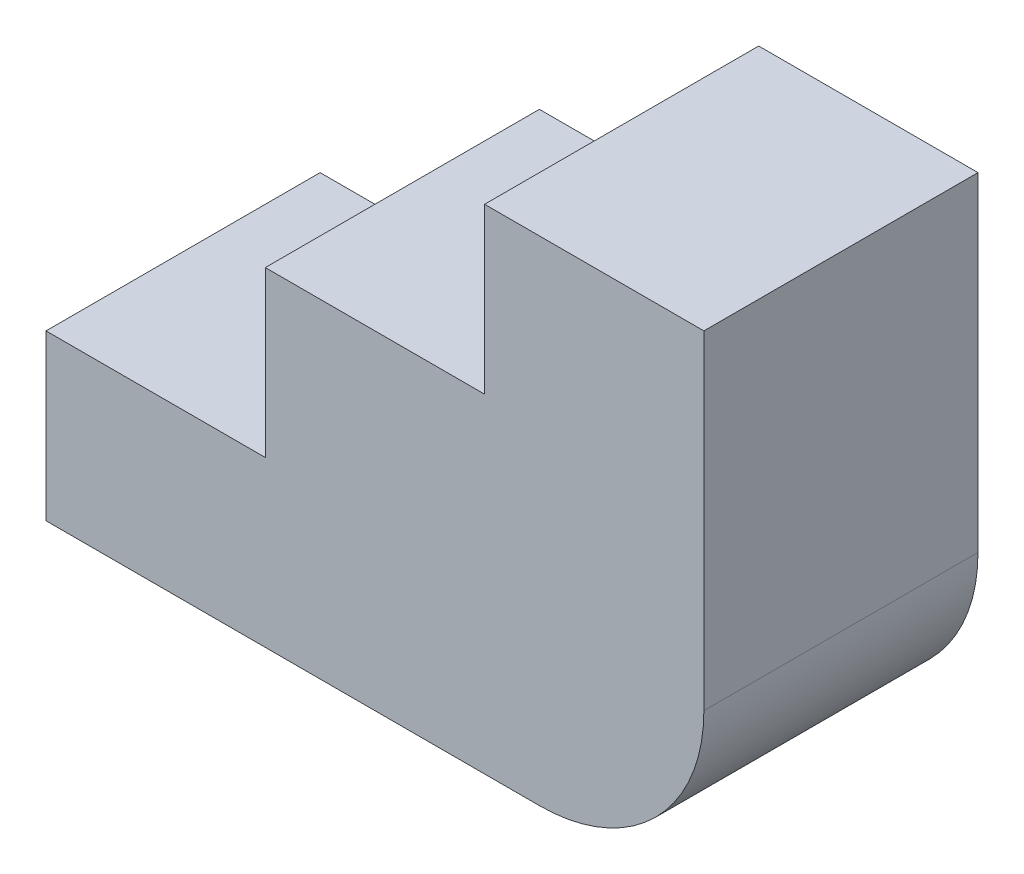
ISO-10303-21;
HEADER;
FILE_DESCRIPTION(('STEP AP214'),'2;1');
FILE_NAME('part.step','',(''),(''),'','','');
FILE_SCHEMA(('AUTOMOTIVE_DESIGN { 1 0 10303 214 1 1 1 1 }'));
ENDSEC;
DATA;
#1=APPLICATION_CONTEXT('core data for automotive mechanical design processes');
#2=APPLICATION_PROTOCOL_DEFINITION('international standard','automotive_design',2000,#1);
#3=PRODUCT_CONTEXT('',#1,'mechanical');
#4=PRODUCT('Part','Part','',(#3));
#5=PRODUCT_RELATED_PRODUCT_CATEGORY('part','',(#4));
#6=PRODUCT_DEFINITION_FORMATION('','',#4);
#7=PRODUCT_DEFINITION_CONTEXT('part definition',#1,'design');
#8=PRODUCT_DEFINITION('design','',#6,#7);
#9=PRODUCT_DEFINITION_SHAPE('','',#8);
#10=(LENGTH_UNIT() NAMED_UNIT(*) SI_UNIT(.MILLI.,.METRE.));
#11=(NAMED_UNIT(*) PLANE_ANGLE_UNIT() SI_UNIT($,.RADIAN.));
#12=(NAMED_UNIT(*) SI_UNIT($,.STERADIAN.) SOLID_ANGLE_UNIT());
#13=UNCERTAINTY_MEASURE_WITH_UNIT(LENGTH_MEASURE(1.E-05),#10,'distance_accuracy_value','');
#14=(GEOMETRIC_REPRESENTATION_CONTEXT(3) GLOBAL_UNCERTAINTY_ASSIGNED_CONTEXT((#13)) GLOBAL_UNIT_ASSIGNED_CONTEXT((#10,
#11,#12)) REPRESENTATION_CONTEXT('',''));
#15=CARTESIAN_POINT('',(0.,0.,0.));
#16=DIRECTION('',(0.,0.,1.));
#17=DIRECTION('',(1.,0.,0.));
#18=AXIS2_PLACEMENT_3D('',#15,#16,#17);
#19=CARTESIAN_POINT('',(0.,0.,25.));
#20=DIRECTION('',(0.,-1.,0.));
#21=DIRECTION('',(0.,0.,-1.));
#22=AXIS2_PLACEMENT_3D('',#19,#20,#21);
#23=PLANE('',#22);
#24=DIRECTION('',(-1.,0.,0.));
#25=VECTOR('',#24,1.);
#26=CARTESIAN_POINT('',(0.,0.,0.));
#27=LINE('',#26,#25);
#28=CARTESIAN_POINT('',(20.,0.,0.));
#29=VERTEX_POINT('',#28);
#30=CARTESIAN_POINT('',(0.,0.,0.));
#31=VERTEX_POINT('',#30);
#32=EDGE_CURVE('E152',#29,#31,#27,.T.);
#33=ORIENTED_EDGE('',*,*,#32,.T.);
#34=DIRECTION('',(0.,0.,-1.));
#35=VECTOR('',#34,1.);
#36=CARTESIAN_POINT('',(0.,0.,25.));
#37=LINE('',#36,#35);
#38=CARTESIAN_POINT('',(0.,0.,25.));
#39=VERTEX_POINT('',#38);
#40=EDGE_CURVE('E11',#39,#31,#37,.T.);
#41=ORIENTED_EDGE('',*,*,#40,.F.);
#42=DIRECTION('',(-1.,0.,0.));
#43=VECTOR('',#42,1.);
#44=CARTESIAN_POINT('',(0.,0.,25.));
#45=LINE('',#44,#43);
#46=CARTESIAN_POINT('',(20.,0.,25.));
#47=VERTEX_POINT('',#46);
#48=EDGE_CURVE('E177',#47,#39,#45,.T.);
#49=ORIENTED_EDGE('',*,*,#48,.F.);
#50=DIRECTION('',(0.,0.,-1.));
#51=VECTOR('',#50,1.);
#52=CARTESIAN_POINT('',(20.,0.,25.));
#53=LINE('',#52,#51);
#54=EDGE_CURVE('E148',#47,#29,#53,.T.);
#55=ORIENTED_EDGE('',*,*,#54,.T.);
#56=EDGE_LOOP('',(#33,#41,#49,#55));
#57=FACE_BOUND('',#56,.T.);
#58=ADVANCED_FACE('F45',(#57),#23,.F.);
#59=CARTESIAN_POINT('',(0.,0.,25.));
#60=DIRECTION('',(1.,0.,0.));
#61=DIRECTION('',(0.,0.,-1.));
#62=AXIS2_PLACEMENT_3D('',#59,#60,#61);
#63=PLANE('',#62);
#64=DIRECTION('',(0.,-1.,0.));
#65=VECTOR('',#64,1.);
#66=CARTESIAN_POINT('',(0.,0.,0.));
#67=LINE('',#66,#65);
#68=CARTESIAN_POINT('',(0.,-15.,0.));
#69=VERTEX_POINT('',#68);
#70=EDGE_CURVE('E156',#31,#69,#67,.T.);
#71=ORIENTED_EDGE('',*,*,#70,.T.);
#72=DIRECTION('',(0.,0.,-1.));
#73=VECTOR('',#72,1.);
#74=CARTESIAN_POINT('',(0.,-15.,25.));
#75=LINE('',#74,#73);
#76=CARTESIAN_POINT('',(0.,-15.,25.));
#77=VERTEX_POINT('',#76);
#78=EDGE_CURVE('E54',#77,#69,#75,.T.);
#79=ORIENTED_EDGE('',*,*,#78,.F.);
#80=DIRECTION('',(0.,-1.,0.));
#81=VECTOR('',#80,1.);
#82=CARTESIAN_POINT('',(0.,0.,25.));
#83=LINE('',#82,#81);
#84=EDGE_CURVE('E108',#39,#77,#83,.T.);
#85=ORIENTED_EDGE('',*,*,#84,.F.);
#86=ORIENTED_EDGE('',*,*,#40,.T.);
#87=EDGE_LOOP('',(#71,#79,#85,#86));
#88=FACE_BOUND('',#87,.T.);
#89=ADVANCED_FACE('F233',(#88),#63,.F.);
#90=CARTESIAN_POINT('',(0.,-15.,25.));
#91=DIRECTION('',(0.,1.,0.));
#92=DIRECTION('',(0.,0.,1.));
#93=AXIS2_PLACEMENT_3D('',#90,#91,#92);
#94=PLANE('',#93);
#95=DIRECTION('',(1.,0.,0.));
#96=VECTOR('',#95,1.);
#97=CARTESIAN_POINT('',(0.,-15.,0.));
#98=LINE('',#97,#96);
#99=CARTESIAN_POINT('',(44.9999999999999,-15.,0.));
#100=VERTEX_POINT('',#99);
#101=EDGE_CURVE('E159',#69,#100,#98,.T.);
#102=ORIENTED_EDGE('',*,*,#101,.T.);
#103=DIRECTION('',(0.,0.,-1.));
#104=VECTOR('',#103,1.);
#105=CARTESIAN_POINT('',(44.9999999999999,-15.,25.));
#106=LINE('',#105,#104);
#107=CARTESIAN_POINT('',(44.9999999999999,-15.,25.));
#108=VERTEX_POINT('',#107);
#109=EDGE_CURVE('E192',#108,#100,#106,.T.);
#110=ORIENTED_EDGE('',*,*,#109,.F.);
#111=DIRECTION('',(1.,0.,0.));
#112=VECTOR('',#111,1.);
#113=CARTESIAN_POINT('',(0.,-15.,25.));
#114=LINE('',#113,#112);
#115=EDGE_CURVE('E202',#77,#108,#114,.T.);
#116=ORIENTED_EDGE('',*,*,#115,.F.);
#117=ORIENTED_EDGE('',*,*,#78,.T.);
#118=EDGE_LOOP('',(#102,#110,#116,#117));
#119=FACE_BOUND('',#118,.T.);
#120=ADVANCED_FACE('F200',(#119),#94,.F.);
#121=CARTESIAN_POINT('',(45.,0.,25.));
#122=DIRECTION('',(0.,0.,-1.));
#123=DIRECTION('',(-1.,0.,0.));
#124=AXIS2_PLACEMENT_3D('',#121,#122,#123);
#125=CYLINDRICAL_SURFACE('',#124,15.);
#126=CARTESIAN_POINT('',(45.,0.,0.));
#127=DIRECTION('',(0.,0.,1.));
#128=DIRECTION('',(1.,0.,0.));
#129=AXIS2_PLACEMENT_3D('',#126,#127,#128);
#130=CIRCLE('',#129,15.);
#131=CARTESIAN_POINT('',(60.,0.,0.));
#132=VERTEX_POINT('',#131);
#133=EDGE_CURVE('E162',#100,#132,#130,.T.);
#134=ORIENTED_EDGE('',*,*,#133,.T.);
#135=DIRECTION('',(0.,0.,-1.));
#136=VECTOR('',#135,1.);
#137=CARTESIAN_POINT('',(60.,0.,25.));
#138=LINE('',#137,#136);
#139=CARTESIAN_POINT('',(60.,0.,25.));
#140=VERTEX_POINT('',#139);
#141=EDGE_CURVE('E188',#140,#132,#138,.T.);
#142=ORIENTED_EDGE('',*,*,#141,.F.);
#143=CARTESIAN_POINT('',(45.,0.,25.));
#144=DIRECTION('',(0.,0.,1.));
#145=DIRECTION('',(1.,0.,0.));
#146=AXIS2_PLACEMENT_3D('',#143,#144,#145);
#147=CIRCLE('',#146,15.);
#148=EDGE_CURVE('E219',#108,#140,#147,.T.);
#149=ORIENTED_EDGE('',*,*,#148,.F.);
#150=ORIENTED_EDGE('',*,*,#109,.T.);
#151=EDGE_LOOP('',(#134,#142,#149,#150));
#152=FACE_BOUND('',#151,.T.);
#153=ADVANCED_FACE('F211',(#152),#125,.T.);
#154=CARTESIAN_POINT('',(60.,1.04083408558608E-13,25.));
#155=DIRECTION('',(-1.,0.,0.));
#156=DIRECTION('',(0.,0.,1.));
#157=AXIS2_PLACEMENT_3D('',#154,#155,#156);
#158=PLANE('',#157);
#159=DIRECTION('',(0.,1.,0.));
#160=VECTOR('',#159,1.);
#161=CARTESIAN_POINT('',(60.,1.04083408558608E-13,0.));
#162=LINE('',#161,#160);
#163=CARTESIAN_POINT('',(60.,30.,0.));
#164=VERTEX_POINT('',#163);
#165=EDGE_CURVE('E165',#132,#164,#162,.T.);
#166=ORIENTED_EDGE('',*,*,#165,.T.);
#167=DIRECTION('',(0.,0.,-1.));
#168=VECTOR('',#167,1.);
#169=CARTESIAN_POINT('',(60.,30.,25.));
#170=LINE('',#169,#168);
#171=CARTESIAN_POINT('',(60.,30.,25.));
#172=VERTEX_POINT('',#171);
#173=EDGE_CURVE('E184',#172,#164,#170,.T.);
#174=ORIENTED_EDGE('',*,*,#173,.F.);
#175=DIRECTION('',(0.,1.,0.));
#176=VECTOR('',#175,1.);
#177=CARTESIAN_POINT('',(60.,1.04083408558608E-13,25.));
#178=LINE('',#177,#176);
#179=EDGE_CURVE('E217',#140,#172,#178,.T.);
#180=ORIENTED_EDGE('',*,*,#179,.F.);
#181=ORIENTED_EDGE('',*,*,#141,.T.);
#182=EDGE_LOOP('',(#166,#174,#180,#181));
#183=FACE_BOUND('',#182,.T.);
#184=ADVANCED_FACE('F215',(#183),#158,.F.);
#185=CARTESIAN_POINT('',(40.,30.,25.));
#186=DIRECTION('',(0.,-1.,0.));
#187=DIRECTION('',(0.,0.,-1.));
#188=AXIS2_PLACEMENT_3D('',#185,#186,#187);
#189=PLANE('',#188);
#190=DIRECTION('',(-1.,0.,0.));
#191=VECTOR('',#190,1.);
#192=CARTESIAN_POINT('',(40.,30.,0.));
#193=LINE('',#192,#191);
#194=CARTESIAN_POINT('',(40.,30.,0.));
#195=VERTEX_POINT('',#194);
#196=EDGE_CURVE('E168',#164,#195,#193,.T.);
#197=ORIENTED_EDGE('',*,*,#196,.T.);
#198=DIRECTION('',(0.,0.,-1.));
#199=VECTOR('',#198,1.);
#200=CARTESIAN_POINT('',(40.,30.,25.));
#201=LINE('',#200,#199);
#202=CARTESIAN_POINT('',(40.,30.,25.));
#203=VERTEX_POINT('',#202);
#204=EDGE_CURVE('E141',#203,#195,#201,.T.);
#205=ORIENTED_EDGE('',*,*,#204,.F.);
#206=DIRECTION('',(-1.,0.,0.));
#207=VECTOR('',#206,1.);
#208=CARTESIAN_POINT('',(40.,30.,25.));
#209=LINE('',#208,#207);
#210=EDGE_CURVE('E130',#172,#203,#209,.T.);
#211=ORIENTED_EDGE('',*,*,#210,.F.);
#212=ORIENTED_EDGE('',*,*,#173,.T.);
#213=EDGE_LOOP('',(#197,#205,#211,#212));
#214=FACE_BOUND('',#213,.T.);
#215=ADVANCED_FACE('F245',(#214),#189,.F.);
#216=CARTESIAN_POINT('',(40.,15.,25.));
#217=DIRECTION('',(1.,0.,0.));
#218=DIRECTION('',(0.,0.,-1.));
#219=AXIS2_PLACEMENT_3D('',#216,#217,#218);
#220=PLANE('',#219);
#221=DIRECTION('',(0.,-1.,0.));
#222=VECTOR('',#221,1.);
#223=CARTESIAN_POINT('',(40.,15.,0.));
#224=LINE('',#223,#222);
#225=CARTESIAN_POINT('',(40.,15.,0.));
#226=VERTEX_POINT('',#225);
#227=EDGE_CURVE('E139',#195,#226,#224,.T.);
#228=ORIENTED_EDGE('',*,*,#227,.T.);
#229=DIRECTION('',(0.,0.,-1.));
#230=VECTOR('',#229,1.);
#231=CARTESIAN_POINT('',(40.,15.,25.));
#232=LINE('',#231,#230);
#233=CARTESIAN_POINT('',(40.,15.,25.));
#234=VERTEX_POINT('',#233);
#235=EDGE_CURVE('E136',#234,#226,#232,.T.);
#236=ORIENTED_EDGE('',*,*,#235,.F.);
#237=DIRECTION('',(0.,-1.,0.));
#238=VECTOR('',#237,1.);
#239=CARTESIAN_POINT('',(40.,15.,25.));
#240=LINE('',#239,#238);
#241=EDGE_CURVE('E124',#203,#234,#240,.T.);
#242=ORIENTED_EDGE('',*,*,#241,.F.);
#243=ORIENTED_EDGE('',*,*,#204,.T.);
#244=EDGE_LOOP('',(#228,#236,#242,#243));
#245=FACE_BOUND('',#244,.T.);
#246=ADVANCED_FACE('F137',(#245),#220,.F.);
#247=CARTESIAN_POINT('',(20.,15.,25.));
#248=DIRECTION('',(0.,-1.,0.));
#249=DIRECTION('',(0.,0.,-1.));
#250=AXIS2_PLACEMENT_3D('',#247,#248,#249);
#251=PLANE('',#250);
#252=DIRECTION('',(-1.,0.,0.));
#253=VECTOR('',#252,1.);
#254=CARTESIAN_POINT('',(20.,15.,0.));
#255=LINE('',#254,#253);
#256=CARTESIAN_POINT('',(20.,15.,0.));
#257=VERTEX_POINT('',#256);
#258=EDGE_CURVE('E94',#226,#257,#255,.T.);
#259=ORIENTED_EDGE('',*,*,#258,.T.);
#260=DIRECTION('',(0.,0.,-1.));
#261=VECTOR('',#260,1.);
#262=CARTESIAN_POINT('',(20.,15.,25.));
#263=LINE('',#262,#261);
#264=CARTESIAN_POINT('',(20.,15.,25.));
#265=VERTEX_POINT('',#264);
#266=EDGE_CURVE('E142',#265,#257,#263,.T.);
#267=ORIENTED_EDGE('',*,*,#266,.F.);
#268=DIRECTION('',(-1.,0.,0.));
#269=VECTOR('',#268,1.);
#270=CARTESIAN_POINT('',(20.,15.,25.));
#271=LINE('',#270,#269);
#272=EDGE_CURVE('E128',#234,#265,#271,.T.);
#273=ORIENTED_EDGE('',*,*,#272,.F.);
#274=ORIENTED_EDGE('',*,*,#235,.T.);
#275=EDGE_LOOP('',(#259,#267,#273,#274));
#276=FACE_BOUND('',#275,.T.);
#277=ADVANCED_FACE('F144',(#276),#251,.F.);
#278=CARTESIAN_POINT('',(20.,0.,25.));
#279=DIRECTION('',(1.,0.,0.));
#280=DIRECTION('',(0.,0.,-1.));
#281=AXIS2_PLACEMENT_3D('',#278,#279,#280);
#282=PLANE('',#281);
#283=DIRECTION('',(0.,-1.,0.));
#284=VECTOR('',#283,1.);
#285=CARTESIAN_POINT('',(20.,0.,0.));
#286=LINE('',#285,#284);
#287=EDGE_CURVE('E100',#257,#29,#286,.T.);
#288=ORIENTED_EDGE('',*,*,#287,.T.);
#289=ORIENTED_EDGE('',*,*,#54,.F.);
#290=DIRECTION('',(0.,-1.,0.));
#291=VECTOR('',#290,1.);
#292=CARTESIAN_POINT('',(20.,0.,25.));
#293=LINE('',#292,#291);
#294=EDGE_CURVE('E62',#265,#47,#293,.T.);
#295=ORIENTED_EDGE('',*,*,#294,.F.);
#296=ORIENTED_EDGE('',*,*,#266,.T.);
#297=EDGE_LOOP('',(#288,#289,#295,#296));
#298=FACE_BOUND('',#297,.T.);
#299=ADVANCED_FACE('F253',(#298),#282,.F.);
#300=CARTESIAN_POINT('',(45.,0.,25.));
#301=DIRECTION('',(0.,0.,1.));
#302=DIRECTION('',(1.,0.,0.));
#303=AXIS2_PLACEMENT_3D('',#300,#301,#302);
#304=PLANE('',#303);
#305=ORIENTED_EDGE('',*,*,#48,.T.);
#306=ORIENTED_EDGE('',*,*,#84,.T.);
#307=ORIENTED_EDGE('',*,*,#115,.T.);
#308=ORIENTED_EDGE('',*,*,#148,.T.);
#309=ORIENTED_EDGE('',*,*,#179,.T.);
#310=ORIENTED_EDGE('',*,*,#210,.T.);
#311=ORIENTED_EDGE('',*,*,#241,.T.);
#312=ORIENTED_EDGE('',*,*,#272,.T.);
#313=ORIENTED_EDGE('',*,*,#294,.T.);
#314=EDGE_LOOP('',(#305,#306,#307,#308,#309,#310,#311,#312,#313));
#315=FACE_BOUND('',#314,.T.);
#316=ADVANCED_FACE('F126',(#315),#304,.T.);
#317=CARTESIAN_POINT('',(45.,0.,0.));
#318=DIRECTION('',(0.,0.,1.));
#319=DIRECTION('',(1.,0.,0.));
#320=AXIS2_PLACEMENT_3D('',#317,#318,#319);
#321=PLANE('',#320);
#322=ORIENTED_EDGE('',*,*,#32,.F.);
#323=ORIENTED_EDGE('',*,*,#287,.F.);
#324=ORIENTED_EDGE('',*,*,#258,.F.);
#325=ORIENTED_EDGE('',*,*,#227,.F.);
#326=ORIENTED_EDGE('',*,*,#196,.F.);
#327=ORIENTED_EDGE('',*,*,#165,.F.);
#328=ORIENTED_EDGE('',*,*,#133,.F.);
#329=ORIENTED_EDGE('',*,*,#101,.F.);
#330=ORIENTED_EDGE('',*,*,#70,.F.);
#331=EDGE_LOOP('',(#322,#323,#324,#325,#326,#327,#328,#329,#330));
#332=FACE_BOUND('',#331,.T.);
#333=ADVANCED_FACE('F206',(#332),#321,.F.);
#334=CLOSED_SHELL('',(#58,#89,#120,#153,#184,#215,#246,#277,#299,#316,#333));
#335=MANIFOLD_SOLID_BREP('B2',#334);
#336=ADVANCED_BREP_SHAPE_REPRESENTATION('',(#18,#335),#14);
#337=SHAPE_DEFINITION_REPRESENTATION(#9,#336);
ENDSEC;
END-ISO-10303-21;
